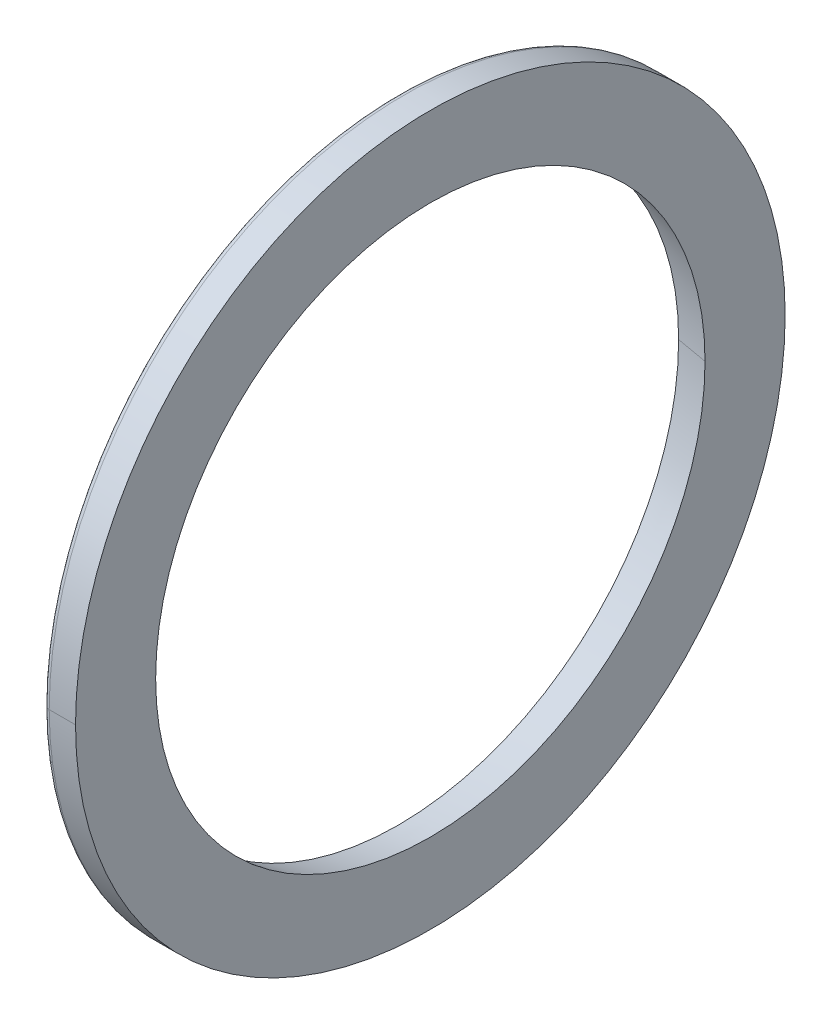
ISO-10303-21;
HEADER;
FILE_DESCRIPTION(('STEP AP214'),'2;1');
FILE_NAME('part.step','',(''),(''),'','','');
FILE_SCHEMA(('AUTOMOTIVE_DESIGN { 1 0 10303 214 1 1 1 1 }'));
ENDSEC;
DATA;
#1=APPLICATION_CONTEXT('core data for automotive mechanical design processes');
#2=APPLICATION_PROTOCOL_DEFINITION('international standard','automotive_design',2000,#1);
#3=PRODUCT_CONTEXT('',#1,'mechanical');
#4=PRODUCT('Part','Part','',(#3));
#5=PRODUCT_RELATED_PRODUCT_CATEGORY('part','',(#4));
#6=PRODUCT_DEFINITION_FORMATION('','',#4);
#7=PRODUCT_DEFINITION_CONTEXT('part definition',#1,'design');
#8=PRODUCT_DEFINITION('design','',#6,#7);
#9=PRODUCT_DEFINITION_SHAPE('','',#8);
#10=(LENGTH_UNIT() NAMED_UNIT(*) SI_UNIT(.MILLI.,.METRE.));
#11=(NAMED_UNIT(*) PLANE_ANGLE_UNIT() SI_UNIT($,.RADIAN.));
#12=(NAMED_UNIT(*) SI_UNIT($,.STERADIAN.) SOLID_ANGLE_UNIT());
#13=UNCERTAINTY_MEASURE_WITH_UNIT(LENGTH_MEASURE(1.E-05),#10,'distance_accuracy_value','');
#14=(GEOMETRIC_REPRESENTATION_CONTEXT(3) GLOBAL_UNCERTAINTY_ASSIGNED_CONTEXT((#13)) GLOBAL_UNIT_ASSIGNED_CONTEXT((#10,
#11,#12)) REPRESENTATION_CONTEXT('',''));
#15=CARTESIAN_POINT('',(0.,0.,0.));
#16=DIRECTION('',(0.,0.,1.));
#17=DIRECTION('',(1.,0.,0.));
#18=AXIS2_PLACEMENT_3D('',#15,#16,#17);
#19=CARTESIAN_POINT('',(0.,76.25,0.));
#20=DIRECTION('',(-1.,0.,0.));
#21=DIRECTION('',(0.,0.,1.));
#22=AXIS2_PLACEMENT_3D('',#19,#20,#21);
#23=PLANE('',#22);
#24=CARTESIAN_POINT('',(0.,0.,0.));
#25=DIRECTION('',(1.,0.,0.));
#26=DIRECTION('',(0.,0.,-1.));
#27=AXIS2_PLACEMENT_3D('',#24,#25,#26);
#28=CIRCLE('',#27,61.234288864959);
#29=CARTESIAN_POINT('',(0.,0.,-61.234288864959));
#30=VERTEX_POINT('',#29);
#31=CARTESIAN_POINT('',(0.,0.,61.234288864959));
#32=VERTEX_POINT('',#31);
#33=EDGE_CURVE('E11',#30,#32,#28,.T.);
#34=ORIENTED_EDGE('',*,*,#33,.T.);
#35=CARTESIAN_POINT('',(0.,0.,0.));
#36=DIRECTION('',(1.,0.,0.));
#37=DIRECTION('',(0.,0.,-1.));
#38=AXIS2_PLACEMENT_3D('',#35,#36,#37);
#39=CIRCLE('',#38,61.234288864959);
#40=EDGE_CURVE('E25',#32,#30,#39,.T.);
#41=ORIENTED_EDGE('',*,*,#40,.T.);
#42=EDGE_LOOP('',(#34,#41));
#43=FACE_BOUND('',#42,.T.);
#44=CARTESIAN_POINT('',(0.,0.,0.));
#45=DIRECTION('',(1.,0.,0.));
#46=DIRECTION('',(0.,0.,-1.));
#47=AXIS2_PLACEMENT_3D('',#44,#45,#46);
#48=CIRCLE('',#47,76.2499999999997);
#49=CARTESIAN_POINT('',(0.,0.,-76.2499999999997));
#50=VERTEX_POINT('',#49);
#51=CARTESIAN_POINT('',(0.,0.,76.2499999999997));
#52=VERTEX_POINT('',#51);
#53=EDGE_CURVE('E211',#50,#52,#48,.T.);
#54=ORIENTED_EDGE('',*,*,#53,.F.);
#55=CARTESIAN_POINT('',(0.,0.,0.));
#56=DIRECTION('',(1.,0.,0.));
#57=DIRECTION('',(0.,0.,-1.));
#58=AXIS2_PLACEMENT_3D('',#55,#56,#57);
#59=CIRCLE('',#58,76.2499999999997);
#60=EDGE_CURVE('E209',#52,#50,#59,.T.);
#61=ORIENTED_EDGE('',*,*,#60,.F.);
#62=EDGE_LOOP('',(#54,#61));
#63=FACE_BOUND('',#62,.T.);
#64=ADVANCED_FACE('F17',(#43,#63),#23,.T.);
#65=CARTESIAN_POINT('',(1.25000000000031,0.,0.));
#66=DIRECTION('',(1.,0.,0.));
#67=DIRECTION('',(0.,1.,0.));
#68=AXIS2_PLACEMENT_3D('',#65,#66,#67);
#69=TOROIDAL_SURFACE('',#68,76.2499999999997,1.25000000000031);
#70=ORIENTED_EDGE('',*,*,#60,.T.);
#71=CARTESIAN_POINT('',(0.,-3.40362985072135E-13,-76.2499999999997));
#72=CARTESIAN_POINT('',(-4.33860969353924E-07,-3.59950822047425E-13,-76.2704530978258));
#73=CARTESIAN_POINT('',(0.000501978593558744,-3.50293850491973E-13,-76.2909061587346));
#74=CARTESIAN_POINT('',(0.00250938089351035,-3.30979687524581E-13,-76.3317630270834));
#75=CARTESIAN_POINT('',(0.00401437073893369,-3.2132249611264E-13,-76.3521668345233));
#76=CARTESIAN_POINT('',(0.00802381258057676,-3.60497290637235E-13,-76.3928760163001));
#77=CARTESIAN_POINT('',(0.0105282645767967,-4.09329276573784E-13,-76.4131813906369));
#78=CARTESIAN_POINT('',(0.0165304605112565,-4.08807139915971E-13,-76.453644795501));
#79=CARTESIAN_POINT('',(0.0200282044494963,-3.59453017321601E-13,-76.4738028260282));
#80=CARTESIAN_POINT('',(0.0280085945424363,-3.23450051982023E-13,-76.5139229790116));
#81=CARTESIAN_POINT('',(0.0324912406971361,-3.36801209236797E-13,-76.5338851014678));
#82=CARTESIAN_POINT('',(0.0424306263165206,-3.46636284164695E-13,-76.5735653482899));
#83=CARTESIAN_POINT('',(0.0478873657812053,-3.43120201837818E-13,-76.5932834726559));
#84=CARTESIAN_POINT('',(0.0597617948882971,-3.40845183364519E-13,-76.6324282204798));
#85=CARTESIAN_POINT('',(0.0661794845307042,-3.42086247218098E-13,-76.6518548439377));
#86=CARTESIAN_POINT('',(0.0799603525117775,-3.42399225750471E-13,-76.6903697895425));
#87=CARTESIAN_POINT('',(0.0873235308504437,-3.41471140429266E-13,-76.7094581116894));
#88=CARTESIAN_POINT('',(0.102977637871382,-3.43525363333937E-13,-76.747250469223));
#89=CARTESIAN_POINT('',(0.111268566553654,-3.46507671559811E-13,-76.7659545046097));
#90=CARTESIAN_POINT('',(0.128758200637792,-3.38989574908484E-13,-76.8029332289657));
#91=CARTESIAN_POINT('',(0.137956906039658,-3.28489170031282E-13,-76.8212079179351));
#92=CARTESIAN_POINT('',(0.157239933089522,-3.57497324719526E-13,-76.8572839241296));
#93=CARTESIAN_POINT('',(0.16732425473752,-3.97005884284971E-13,-76.8750852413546));
#94=CARTESIAN_POINT('',(0.188354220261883,-4.26045932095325E-13,-76.9101716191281));
#95=CARTESIAN_POINT('',(0.199299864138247,-4.15577420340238E-13,-76.9274566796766));
#96=CARTESIAN_POINT('',(0.222026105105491,-4.08029226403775E-13,-76.9614689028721));
#97=CARTESIAN_POINT('',(0.233806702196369,-4.10949544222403E-13,-76.9781960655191));
#98=CARTESIAN_POINT('',(0.258174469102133,-4.13194025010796E-13,-77.0110521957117));
#99=CARTESIAN_POINT('',(0.270761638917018,-4.12518187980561E-13,-77.0271811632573));
#100=CARTESIAN_POINT('',(0.296712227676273,-4.12143102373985E-13,-77.0588020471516));
#101=CARTESIAN_POINT('',(0.310075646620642,-4.12443853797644E-13,-77.0742939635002));
#102=CARTESIAN_POINT('',(0.337546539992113,-4.12714709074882E-13,-77.1046034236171));
#103=CARTESIAN_POINT('',(0.351654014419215,-4.12684812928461E-13,-77.1194209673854));
#104=CARTESIAN_POINT('',(0.380579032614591,-4.12949375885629E-13,-77.1483459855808));
#105=CARTESIAN_POINT('',(0.395396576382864,-4.13243834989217E-13,-77.1624534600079));
#106=CARTESIAN_POINT('',(0.425706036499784,-4.12843187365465E-13,-77.1899243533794));
#107=CARTESIAN_POINT('',(0.44119795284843,-4.12148080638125E-13,-77.2032877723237));
#108=CARTESIAN_POINT('',(0.472818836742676,-4.14367891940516E-13,-77.229238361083));
#109=CARTESIAN_POINT('',(0.488947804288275,-4.17282809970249E-13,-77.2418255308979));
#110=CARTESIAN_POINT('',(0.521803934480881,-4.09637196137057E-13,-77.2661932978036));
#111=CARTESIAN_POINT('',(0.538531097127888,-3.99076664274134E-13,-77.2779738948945));
#112=CARTESIAN_POINT('',(0.572543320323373,-4.28221485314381E-13,-77.3007001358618));
#113=CARTESIAN_POINT('',(0.589828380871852,-4.67926838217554E-13,-77.3116457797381));
#114=CARTESIAN_POINT('',(0.624914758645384,-4.9707440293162E-13,-77.3326757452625));
#115=CARTESIAN_POINT('',(0.642716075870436,-4.86516614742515E-13,-77.3427600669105));
#116=CARTESIAN_POINT('',(0.678792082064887,-4.7886203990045E-13,-77.3620430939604));
#117=CARTESIAN_POINT('',(0.697066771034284,-4.8176525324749E-13,-77.3712417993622));
#118=CARTESIAN_POINT('',(0.734045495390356,-4.83957670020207E-13,-77.3887314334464));
#119=CARTESIAN_POINT('',(0.752749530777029,-4.83246873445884E-13,-77.3970223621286));
#120=CARTESIAN_POINT('',(0.790541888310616,-4.82786344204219E-13,-77.4126764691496));
#121=CARTESIAN_POINT('',(0.80963021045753,-4.83036611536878E-13,-77.4200396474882));
#122=CARTESIAN_POINT('',(0.848145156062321,-4.83272178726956E-13,-77.4338205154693));
#123=CARTESIAN_POINT('',(0.867571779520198,-4.83257478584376E-13,-77.4402382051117));
#124=CARTESIAN_POINT('',(0.906716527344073,-4.83291498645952E-13,-77.4521126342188));
#125=CARTESIAN_POINT('',(0.926434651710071,-4.83340218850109E-13,-77.4575693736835));
#126=CARTESIAN_POINT('',(0.966114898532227,-4.83412981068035E-13,-77.4675087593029));
#127=CARTESIAN_POINT('',(0.986077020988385,-4.83437023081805E-13,-77.4719914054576));
#128=CARTESIAN_POINT('',(1.02619717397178,-4.83483943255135E-13,-77.4799717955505));
#129=CARTESIAN_POINT('',(1.04635520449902,-4.83506821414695E-13,-77.4834695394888));
#130=CARTESIAN_POINT('',(1.08681860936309,-4.83545050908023E-13,-77.4894717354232));
#131=CARTESIAN_POINT('',(1.10712398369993,-4.8356040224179E-13,-77.4919761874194));
#132=CARTESIAN_POINT('',(1.14783316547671,-4.83585200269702E-13,-77.4959856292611));
#133=CARTESIAN_POINT('',(1.16823697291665,-4.83594646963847E-13,-77.4974906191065));
#134=CARTESIAN_POINT('',(1.20909384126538,-4.83607284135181E-13,-77.4994980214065));
#135=CARTESIAN_POINT('',(1.22954690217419,-4.83610474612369E-13,-77.500000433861));
#136=CARTESIAN_POINT('',(1.2500000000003,-4.83610361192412E-13,-77.5));
#137=B_SPLINE_CURVE_WITH_KNOTS('',3,(#71,#72,#73,#74,#75,#76,#77,#78,#79,#80,#81,#82,#83,#84,
#85,#86,#87,#88,#89,#90,#91,#92,#93,#94,#95,#96,#97,#98,#99,#100,#101,#102,#103,#104,#105,#106,
#107,#108,#109,#110,#111,#112,#113,#114,#115,#116,#117,#118,#119,#120,#121,#122,#123,#124,#125,
#126,#127,#128,#129,#130,#131,#132,#133,#134,#135,#136),.UNSPECIFIED.,.F.,.F.,(4,2,2,2,2,2,2,2,
2,2,2,2,2,2,2,2,2,2,2,2,2,2,2,2,2,2,2,2,2,2,2,2,4),(0.,0.0613530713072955,0.122706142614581,
0.18405921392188,0.245412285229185,0.306765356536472,0.368118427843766,0.429471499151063,
0.490824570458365,0.552177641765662,0.613530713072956,0.67488378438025,0.73623685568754,
0.797589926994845,0.858942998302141,0.920296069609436,0.981649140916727,1.04300221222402,
1.10435528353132,1.16570835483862,1.22706142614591,1.28841449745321,1.34976756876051,
1.4111206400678,1.4724737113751,1.53382678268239,1.59517985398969,1.65653292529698,
1.71788599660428,1.77923906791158,1.84059213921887,1.90194521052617,1.96329828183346),.UNSPECIFIED.);
#138=CARTESIAN_POINT('',(1.25,0.,-77.5));
#139=VERTEX_POINT('',#138);
#140=EDGE_CURVE('E179',#50,#139,#137,.T.);
#141=ORIENTED_EDGE('',*,*,#140,.T.);
#142=CARTESIAN_POINT('',(1.25,0.,0.));
#143=DIRECTION('',(1.,0.,0.));
#144=DIRECTION('',(0.,0.,-1.));
#145=AXIS2_PLACEMENT_3D('',#142,#143,#144);
#146=CIRCLE('',#145,77.5);
#147=CARTESIAN_POINT('',(1.25,0.,77.5));
#148=VERTEX_POINT('',#147);
#149=EDGE_CURVE('E196',#148,#139,#146,.T.);
#150=ORIENTED_EDGE('',*,*,#149,.F.);
#151=CARTESIAN_POINT('',(0.,2.63301448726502E-13,76.2499999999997));
#152=CARTESIAN_POINT('',(-4.33860969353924E-07,2.82868203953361E-13,76.2704530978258));
#153=CARTESIAN_POINT('',(0.000501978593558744,2.7319076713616E-13,76.2909061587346));
#154=CARTESIAN_POINT('',(0.00250938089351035,2.53835723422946E-13,76.3317630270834));
#155=CARTESIAN_POINT('',(0.00401437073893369,2.44158116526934E-13,76.3521668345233));
#156=CARTESIAN_POINT('',(0.00802381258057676,2.8329094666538E-13,76.3928760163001));
#157=CARTESIAN_POINT('',(0.0105282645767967,3.32101383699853E-13,76.4131813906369));
#158=CARTESIAN_POINT('',(0.0165304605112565,3.31541229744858E-13,76.453644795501));
#159=CARTESIAN_POINT('',(0.0200282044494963,2.82170638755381E-13,76.4738028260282));
#160=CARTESIAN_POINT('',(0.0280085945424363,2.46116441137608E-13,76.5139229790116));
#161=CARTESIAN_POINT('',(0.0324912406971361,2.59432834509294E-13,76.5338851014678));
#162=CARTESIAN_POINT('',(0.0424306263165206,2.69267670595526E-13,76.5735653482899));
#163=CARTESIAN_POINT('',(0.0478873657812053,2.6578611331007E-13,76.5932834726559));
#164=CARTESIAN_POINT('',(0.0597617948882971,2.63322763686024E-13,76.6324282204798));
#165=CARTESIAN_POINT('',(0.0661794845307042,2.64340971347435E-13,76.6518548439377));
#166=CARTESIAN_POINT('',(0.0799603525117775,2.65170240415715E-13,76.6903697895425));
#167=CARTESIAN_POINT('',(0.0873235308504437,2.64981301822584E-13,76.7094581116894));
#168=CARTESIAN_POINT('',(0.102977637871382,2.64925238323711E-13,76.747250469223));
#169=CARTESIAN_POINT('',(0.111268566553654,2.65058113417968E-13,76.7659545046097));
#170=CARTESIAN_POINT('',(0.128758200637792,2.65235796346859E-13,76.8029332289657));
#171=CARTESIAN_POINT('',(0.137956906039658,2.65280604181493E-13,76.8212079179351));
#172=CARTESIAN_POINT('',(0.157239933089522,2.65391783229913E-13,76.8572839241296));
#173=CARTESIAN_POINT('',(0.16732425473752,2.654581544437E-13,76.8750852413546));
#174=CARTESIAN_POINT('',(0.188354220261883,2.6558290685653E-13,76.9101716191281));
#175=CARTESIAN_POINT('',(0.199299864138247,2.65641288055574E-13,76.9274566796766));
#176=CARTESIAN_POINT('',(0.222026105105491,2.65757755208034E-13,76.9614689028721));
#177=CARTESIAN_POINT('',(0.233806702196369,2.65815841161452E-13,76.9781960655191));
#178=CARTESIAN_POINT('',(0.258174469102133,2.65929629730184E-13,77.0110521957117));
#179=CARTESIAN_POINT('',(0.270761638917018,2.65985332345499E-13,77.0271811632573));
#180=CARTESIAN_POINT('',(0.296712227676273,2.66094177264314E-13,77.0588020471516));
#181=CARTESIAN_POINT('',(0.310075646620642,2.66147319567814E-13,77.0742939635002));
#182=CARTESIAN_POINT('',(0.337546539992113,2.66253035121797E-13,77.1046034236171));
#183=CARTESIAN_POINT('',(0.351654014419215,2.66305608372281E-13,77.1194209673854));
#184=CARTESIAN_POINT('',(0.380579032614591,2.66401624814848E-13,77.1483459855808));
#185=CARTESIAN_POINT('',(0.395396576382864,2.66445068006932E-13,77.1624534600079));
#186=CARTESIAN_POINT('',(0.425706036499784,2.66554337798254E-13,77.1899243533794));
#187=CARTESIAN_POINT('',(0.44119795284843,2.66620164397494E-13,77.2032877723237));
#188=CARTESIAN_POINT('',(0.472818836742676,2.66656004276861E-13,77.229238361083));
#189=CARTESIAN_POINT('',(0.488947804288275,2.66626017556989E-13,77.2418255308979));
#190=CARTESIAN_POINT('',(0.521803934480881,2.66910837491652E-13,77.2661932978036));
#191=CARTESIAN_POINT('',(0.538531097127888,2.67225644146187E-13,77.2779738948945));
#192=CARTESIAN_POINT('',(0.572543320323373,2.66555192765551E-13,77.3007001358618));
#193=CARTESIAN_POINT('',(0.589828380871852,2.65569934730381E-13,77.3116457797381));
#194=CARTESIAN_POINT('',(0.624914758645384,2.68437591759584E-13,77.3326757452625));
#195=CARTESIAN_POINT('',(0.642716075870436,2.72290506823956E-13,77.3427600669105));
#196=CARTESIAN_POINT('',(0.678792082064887,2.61925870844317E-13,77.3620430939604));
#197=CARTESIAN_POINT('',(0.697066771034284,2.47708319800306E-13,77.3712417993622));
#198=CARTESIAN_POINT('',(0.734045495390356,2.86698567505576E-13,77.3887314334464));
#199=CARTESIAN_POINT('',(0.752749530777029,3.39906366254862E-13,77.3970223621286));
#200=CARTESIAN_POINT('',(0.790541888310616,3.32170863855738E-13,77.4126764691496));
#201=CARTESIAN_POINT('',(0.80963021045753,2.71227562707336E-13,77.4200396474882));
#202=CARTESIAN_POINT('',(0.848145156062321,2.63503528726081E-13,77.4338205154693));
#203=CARTESIAN_POINT('',(0.867571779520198,3.16722795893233E-13,77.4402382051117));
#204=CARTESIAN_POINT('',(0.906716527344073,3.55713252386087E-13,77.4521126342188));
#205=CARTESIAN_POINT('',(0.926434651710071,3.41484441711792E-13,77.4575693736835));
#206=CARTESIAN_POINT('',(0.966114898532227,3.31093685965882E-13,77.4675087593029));
#207=CARTESIAN_POINT('',(0.986077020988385,3.34931740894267E-13,77.4719914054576));
#208=CARTESIAN_POINT('',(1.02619717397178,3.37763103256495E-13,77.4799717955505));
#209=CARTESIAN_POINT('',(1.04635520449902,3.36756410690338E-13,77.4834695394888));
#210=CARTESIAN_POINT('',(1.08681860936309,3.3602950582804E-13,77.4894717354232));
#211=CARTESIAN_POINT('',(1.10712398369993,3.36309293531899E-13,77.4919761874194));
#212=CARTESIAN_POINT('',(1.14783316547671,3.36541831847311E-13,77.4959856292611));
#213=CARTESIAN_POINT('',(1.16823697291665,3.36494582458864E-13,77.4974906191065));
#214=CARTESIAN_POINT('',(1.20909384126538,3.36395731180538E-13,77.4994980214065));
#215=CARTESIAN_POINT('',(1.22954690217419,3.36344129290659E-13,77.500000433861));
#216=CARTESIAN_POINT('',(1.2500000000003,3.36451693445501E-13,77.5));
#217=B_SPLINE_CURVE_WITH_KNOTS('',3,(#151,#152,#153,#154,#155,#156,#157,#158,#159,#160,#161,
#162,#163,#164,#165,#166,#167,#168,#169,#170,#171,#172,#173,#174,#175,#176,#177,#178,#179,#180,
#181,#182,#183,#184,#185,#186,#187,#188,#189,#190,#191,#192,#193,#194,#195,#196,#197,#198,#199,
#200,#201,#202,#203,#204,#205,#206,#207,#208,#209,#210,#211,#212,#213,#214,#215,#216),
.UNSPECIFIED.,.F.,.F.,(4,2,2,2,2,2,2,2,2,2,2,2,2,2,2,2,2,2,2,2,2,2,2,2,2,2,2,2,2,2,2,2,4),(0.,
0.0613530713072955,0.122706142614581,0.18405921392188,0.245412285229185,0.306765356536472,
0.368118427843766,0.429471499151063,0.490824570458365,0.552177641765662,0.613530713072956,
0.67488378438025,0.73623685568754,0.797589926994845,0.858942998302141,0.920296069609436,
0.981649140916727,1.04300221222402,1.10435528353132,1.16570835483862,1.22706142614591,
1.28841449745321,1.34976756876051,1.4111206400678,1.4724737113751,1.53382678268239,
1.59517985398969,1.65653292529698,1.71788599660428,1.77923906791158,1.84059213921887,
1.90194521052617,1.96329828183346),.UNSPECIFIED.);
#218=EDGE_CURVE('E181',#52,#148,#217,.T.);
#219=ORIENTED_EDGE('',*,*,#218,.F.);
#220=EDGE_LOOP('',(#70,#141,#150,#219));
#221=FACE_BOUND('',#220,.T.);
#222=ADVANCED_FACE('F163',(#221),#69,.T.);
#223=CARTESIAN_POINT('',(1.25000000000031,0.,0.));
#224=DIRECTION('',(1.,0.,0.));
#225=DIRECTION('',(0.,-1.,0.));
#226=AXIS2_PLACEMENT_3D('',#223,#224,#225);
#227=TOROIDAL_SURFACE('',#226,76.2499999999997,1.25000000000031);
#228=CARTESIAN_POINT('',(1.25,0.,0.));
#229=DIRECTION('',(1.,0.,0.));
#230=DIRECTION('',(0.,0.,-1.));
#231=AXIS2_PLACEMENT_3D('',#228,#229,#230);
#232=CIRCLE('',#231,77.5);
#233=EDGE_CURVE('E147',#139,#148,#232,.T.);
#234=ORIENTED_EDGE('',*,*,#233,.F.);
#235=ORIENTED_EDGE('',*,*,#140,.F.);
#236=ORIENTED_EDGE('',*,*,#53,.T.);
#237=ORIENTED_EDGE('',*,*,#218,.T.);
#238=EDGE_LOOP('',(#234,#235,#236,#237));
#239=FACE_BOUND('',#238,.T.);
#240=ADVANCED_FACE('F155',(#239),#227,.T.);
#241=CARTESIAN_POINT('',(7.,0.,0.));
#242=DIRECTION('',(-1.,0.,0.));
#243=DIRECTION('',(0.,-1.,0.));
#244=AXIS2_PLACEMENT_3D('',#241,#242,#243);
#245=CYLINDRICAL_SURFACE('',#244,77.5);
#246=CARTESIAN_POINT('',(7.,0.,0.));
#247=DIRECTION('',(1.,0.,0.));
#248=DIRECTION('',(0.,0.,-1.));
#249=AXIS2_PLACEMENT_3D('',#246,#247,#248);
#250=CIRCLE('',#249,77.5);
#251=CARTESIAN_POINT('',(7.,0.,-77.5));
#252=VERTEX_POINT('',#251);
#253=CARTESIAN_POINT('',(7.,0.,77.5));
#254=VERTEX_POINT('',#253);
#255=EDGE_CURVE('E144',#252,#254,#250,.T.);
#256=ORIENTED_EDGE('',*,*,#255,.F.);
#257=CARTESIAN_POINT('',(7.,0.,-77.5));
#258=DIRECTION('',(-1.,0.,0.));
#259=VECTOR('',#258,1.);
#260=LINE('',#257,#259);
#261=EDGE_CURVE('E123',#252,#139,#260,.T.);
#262=ORIENTED_EDGE('',*,*,#261,.T.);
#263=ORIENTED_EDGE('',*,*,#233,.T.);
#264=CARTESIAN_POINT('',(7.,0.,77.5));
#265=DIRECTION('',(-1.,0.,0.));
#266=VECTOR('',#265,1.);
#267=LINE('',#264,#266);
#268=EDGE_CURVE('E79',#254,#148,#267,.T.);
#269=ORIENTED_EDGE('',*,*,#268,.F.);
#270=EDGE_LOOP('',(#256,#262,#263,#269));
#271=FACE_BOUND('',#270,.T.);
#272=ADVANCED_FACE('F101',(#271),#245,.T.);
#273=CARTESIAN_POINT('',(7.,0.,0.));
#274=DIRECTION('',(-1.,0.,0.));
#275=DIRECTION('',(0.,1.,0.));
#276=AXIS2_PLACEMENT_3D('',#273,#274,#275);
#277=CYLINDRICAL_SURFACE('',#276,77.5);
#278=ORIENTED_EDGE('',*,*,#149,.T.);
#279=ORIENTED_EDGE('',*,*,#261,.F.);
#280=CARTESIAN_POINT('',(7.,0.,0.));
#281=DIRECTION('',(1.,0.,0.));
#282=DIRECTION('',(0.,0.,-1.));
#283=AXIS2_PLACEMENT_3D('',#280,#281,#282);
#284=CIRCLE('',#283,77.5);
#285=EDGE_CURVE('E76',#254,#252,#284,.T.);
#286=ORIENTED_EDGE('',*,*,#285,.F.);
#287=ORIENTED_EDGE('',*,*,#268,.T.);
#288=EDGE_LOOP('',(#278,#279,#286,#287));
#289=FACE_BOUND('',#288,.T.);
#290=ADVANCED_FACE('F91',(#289),#277,.T.);
#291=CARTESIAN_POINT('',(7.,60.,0.));
#292=DIRECTION('',(1.,0.,0.));
#293=DIRECTION('',(0.,0.,-1.));
#294=AXIS2_PLACEMENT_3D('',#291,#292,#293);
#295=PLANE('',#294);
#296=ORIENTED_EDGE('',*,*,#255,.T.);
#297=ORIENTED_EDGE('',*,*,#285,.T.);
#298=EDGE_LOOP('',(#296,#297));
#299=FACE_BOUND('',#298,.T.);
#300=CARTESIAN_POINT('',(7.,0.,0.));
#301=DIRECTION('',(1.,0.,0.));
#302=DIRECTION('',(0.,0.,-1.));
#303=AXIS2_PLACEMENT_3D('',#300,#301,#302);
#304=CIRCLE('',#303,60.);
#305=CARTESIAN_POINT('',(7.,0.,-60.));
#306=VERTEX_POINT('',#305);
#307=CARTESIAN_POINT('',(7.,0.,60.));
#308=VERTEX_POINT('',#307);
#309=EDGE_CURVE('E62',#306,#308,#304,.T.);
#310=ORIENTED_EDGE('',*,*,#309,.F.);
#311=CARTESIAN_POINT('',(7.,0.,0.));
#312=DIRECTION('',(1.,0.,0.));
#313=DIRECTION('',(0.,0.,-1.));
#314=AXIS2_PLACEMENT_3D('',#311,#312,#313);
#315=CIRCLE('',#314,60.);
#316=EDGE_CURVE('E58',#308,#306,#315,.T.);
#317=ORIENTED_EDGE('',*,*,#316,.F.);
#318=EDGE_LOOP('',(#310,#317));
#319=FACE_BOUND('',#318,.T.);
#320=ADVANCED_FACE('F60',(#299,#319),#295,.T.);
#321=CARTESIAN_POINT('',(0.,0.,0.));
#322=DIRECTION('',(-1.,0.,0.));
#323=DIRECTION('',(0.,1.,0.));
#324=AXIS2_PLACEMENT_3D('',#321,#322,#323);
#325=CONICAL_SURFACE('',#324,61.234288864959,0.174532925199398);
#326=ORIENTED_EDGE('',*,*,#40,.F.);
#327=CARTESIAN_POINT('',(7.,0.,60.));
#328=DIRECTION('',(-0.984807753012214,0.,0.173648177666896));
#329=VECTOR('',#328,1.);
#330=LINE('',#327,#329);
#331=EDGE_CURVE('E65',#308,#32,#330,.T.);
#332=ORIENTED_EDGE('',*,*,#331,.F.);
#333=ORIENTED_EDGE('',*,*,#316,.T.);
#334=CARTESIAN_POINT('',(7.,0.,-60.));
#335=DIRECTION('',(-0.984807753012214,0.,-0.173648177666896));
#336=VECTOR('',#335,1.);
#337=LINE('',#334,#336);
#338=EDGE_CURVE('E72',#306,#30,#337,.T.);
#339=ORIENTED_EDGE('',*,*,#338,.T.);
#340=EDGE_LOOP('',(#326,#332,#333,#339));
#341=FACE_BOUND('',#340,.T.);
#342=ADVANCED_FACE('F69',(#341),#325,.F.);
#343=CARTESIAN_POINT('',(0.,0.,0.));
#344=DIRECTION('',(-1.,0.,0.));
#345=DIRECTION('',(0.,-1.,0.));
#346=AXIS2_PLACEMENT_3D('',#343,#344,#345);
#347=CONICAL_SURFACE('',#346,61.234288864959,0.174532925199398);
#348=ORIENTED_EDGE('',*,*,#309,.T.);
#349=ORIENTED_EDGE('',*,*,#331,.T.);
#350=ORIENTED_EDGE('',*,*,#33,.F.);
#351=ORIENTED_EDGE('',*,*,#338,.F.);
#352=EDGE_LOOP('',(#348,#349,#350,#351));
#353=FACE_BOUND('',#352,.T.);
#354=ADVANCED_FACE('F74',(#353),#347,.F.);
#355=CLOSED_SHELL('',(#64,#222,#240,#272,#290,#320,#342,#354));
#356=MANIFOLD_SOLID_BREP('B1',#355);
#357=ADVANCED_BREP_SHAPE_REPRESENTATION('',(#18,#356),#14);
#358=SHAPE_DEFINITION_REPRESENTATION(#9,#357);
ENDSEC;
END-ISO-10303-21;
